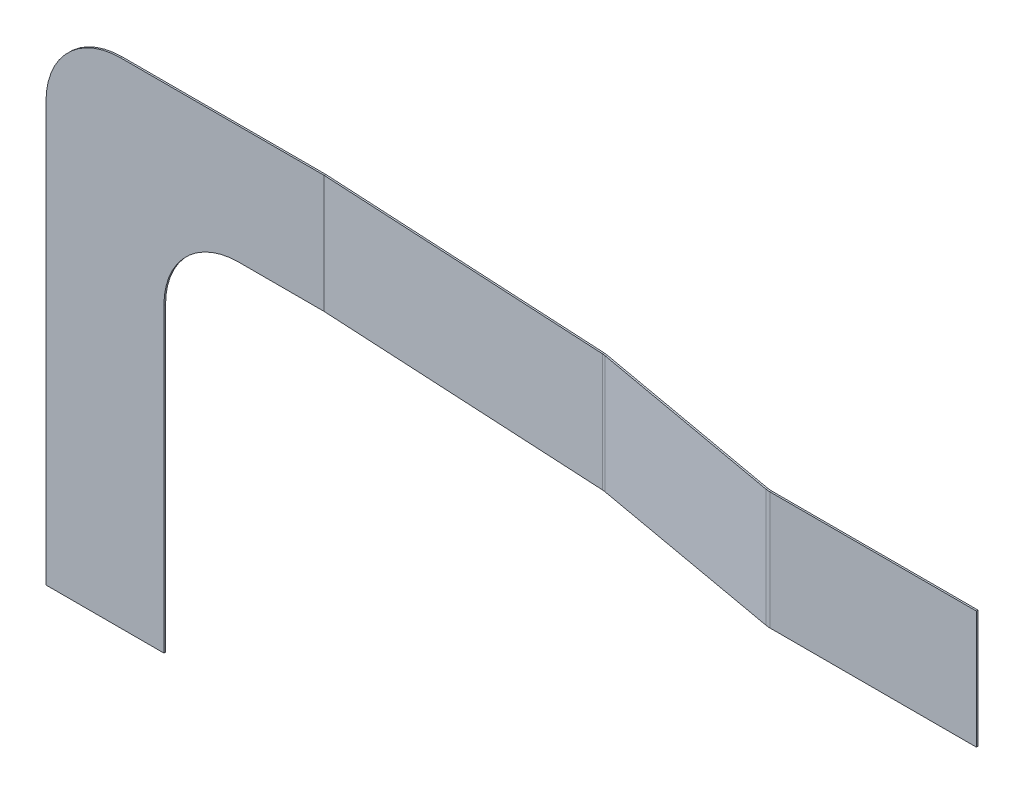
ISO-10303-21;
HEADER;
FILE_DESCRIPTION(('STEP AP214'),'2;1');
FILE_NAME('part.step','',(''),(''),'','','');
FILE_SCHEMA(('AUTOMOTIVE_DESIGN { 1 0 10303 214 1 1 1 1 }'));
ENDSEC;
DATA;
#1=APPLICATION_CONTEXT('core data for automotive mechanical design processes');
#2=APPLICATION_PROTOCOL_DEFINITION('international standard','automotive_design',2000,#1);
#3=PRODUCT_CONTEXT('',#1,'mechanical');
#4=PRODUCT('Part','Part','',(#3));
#5=PRODUCT_RELATED_PRODUCT_CATEGORY('part','',(#4));
#6=PRODUCT_DEFINITION_FORMATION('','',#4);
#7=PRODUCT_DEFINITION_CONTEXT('part definition',#1,'design');
#8=PRODUCT_DEFINITION('design','',#6,#7);
#9=PRODUCT_DEFINITION_SHAPE('','',#8);
#10=(LENGTH_UNIT() NAMED_UNIT(*) SI_UNIT(.MILLI.,.METRE.));
#11=(NAMED_UNIT(*) PLANE_ANGLE_UNIT() SI_UNIT($,.RADIAN.));
#12=(NAMED_UNIT(*) SI_UNIT($,.STERADIAN.) SOLID_ANGLE_UNIT());
#13=UNCERTAINTY_MEASURE_WITH_UNIT(LENGTH_MEASURE(1.E-05),#10,'distance_accuracy_value','');
#14=(GEOMETRIC_REPRESENTATION_CONTEXT(3) GLOBAL_UNCERTAINTY_ASSIGNED_CONTEXT((#13)) GLOBAL_UNIT_ASSIGNED_CONTEXT((#10,
#11,#12)) REPRESENTATION_CONTEXT('',''));
#15=CARTESIAN_POINT('',(0.,0.,0.));
#16=DIRECTION('',(0.,0.,1.));
#17=DIRECTION('',(1.,0.,0.));
#18=AXIS2_PLACEMENT_3D('',#15,#16,#17);
#19=CARTESIAN_POINT('',(26.5299999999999,-35.47,-5.2948));
#20=DIRECTION('',(0.,0.,-1.));
#21=DIRECTION('',(-1.,0.,0.));
#22=AXIS2_PLACEMENT_3D('',#19,#20,#21);
#23=CYLINDRICAL_SURFACE('',#22,6.35);
#24=DIRECTION('',(0.,0.,-1.));
#25=VECTOR('',#24,1.);
#26=CARTESIAN_POINT('',(26.5299999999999,-29.12,-5.2948));
#27=LINE('',#26,#25);
#28=CARTESIAN_POINT('',(26.5299999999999,-29.12,-5.1548));
#29=VERTEX_POINT('',#28);
#30=CARTESIAN_POINT('',(26.5299999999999,-29.12,-5.2948));
#31=VERTEX_POINT('',#30);
#32=EDGE_CURVE('E11',#29,#31,#27,.T.);
#33=ORIENTED_EDGE('',*,*,#32,.F.);
#34=CARTESIAN_POINT('',(26.5299999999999,-35.47,-5.1548));
#35=DIRECTION('',(0.,0.,-1.));
#36=DIRECTION('',(-1.,0.,0.));
#37=AXIS2_PLACEMENT_3D('',#34,#35,#36);
#38=CIRCLE('',#37,6.35);
#39=CARTESIAN_POINT('',(20.1799999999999,-35.47,-5.1548));
#40=VERTEX_POINT('',#39);
#41=EDGE_CURVE('E160',#29,#40,#38,.F.);
#42=ORIENTED_EDGE('',*,*,#41,.T.);
#43=DIRECTION('',(0.,0.,-1.));
#44=VECTOR('',#43,1.);
#45=CARTESIAN_POINT('',(20.1799999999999,-35.47,-5.2948));
#46=LINE('',#45,#44);
#47=CARTESIAN_POINT('',(20.1799999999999,-35.47,-5.2948));
#48=VERTEX_POINT('',#47);
#49=EDGE_CURVE('E49',#40,#48,#46,.T.);
#50=ORIENTED_EDGE('',*,*,#49,.T.);
#51=CARTESIAN_POINT('',(26.5299999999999,-35.47,-5.2948));
#52=DIRECTION('',(0.,0.,-1.));
#53=DIRECTION('',(-1.,0.,0.));
#54=AXIS2_PLACEMENT_3D('',#51,#52,#53);
#55=CIRCLE('',#54,6.35);
#56=EDGE_CURVE('E269',#31,#48,#55,.F.);
#57=ORIENTED_EDGE('',*,*,#56,.F.);
#58=EDGE_LOOP('',(#33,#42,#50,#57));
#59=FACE_BOUND('',#58,.T.);
#60=ADVANCED_FACE('F39',(#59),#23,.F.);
#61=CARTESIAN_POINT('',(20.1799999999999,-29.12,-5.2948));
#62=DIRECTION('',(-1.,0.,0.));
#63=DIRECTION('',(0.,1.,0.));
#64=AXIS2_PLACEMENT_3D('',#61,#62,#63);
#65=PLANE('',#64);
#66=ORIENTED_EDGE('',*,*,#49,.F.);
#67=DIRECTION('',(0.,1.,0.));
#68=VECTOR('',#67,1.);
#69=CARTESIAN_POINT('',(20.1799999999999,0.,-5.1548));
#70=LINE('',#69,#68);
#71=CARTESIAN_POINT('',(20.1799999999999,-61.0106,-5.1548));
#72=VERTEX_POINT('',#71);
#73=EDGE_CURVE('E170',#72,#40,#70,.T.);
#74=ORIENTED_EDGE('',*,*,#73,.F.);
#75=DIRECTION('',(0.,0.,-1.));
#76=VECTOR('',#75,1.);
#77=CARTESIAN_POINT('',(20.1799999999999,-61.0106,-5.2948));
#78=LINE('',#77,#76);
#79=CARTESIAN_POINT('',(20.1799999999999,-61.0106,-5.2948));
#80=VERTEX_POINT('',#79);
#81=EDGE_CURVE('E264',#72,#80,#78,.T.);
#82=ORIENTED_EDGE('',*,*,#81,.T.);
#83=DIRECTION('',(0.,1.,0.));
#84=VECTOR('',#83,1.);
#85=CARTESIAN_POINT('',(20.1799999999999,-29.12,-5.2948));
#86=LINE('',#85,#84);
#87=EDGE_CURVE('E277',#80,#48,#86,.T.);
#88=ORIENTED_EDGE('',*,*,#87,.T.);
#89=EDGE_LOOP('',(#66,#74,#82,#88));
#90=FACE_BOUND('',#89,.T.);
#91=ADVANCED_FACE('F279',(#90),#65,.F.);
#92=CARTESIAN_POINT('',(10.1799999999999,-61.0106,-5.2948));
#93=DIRECTION('',(0.,1.,0.));
#94=DIRECTION('',(1.,0.,0.));
#95=AXIS2_PLACEMENT_3D('',#92,#93,#94);
#96=PLANE('',#95);
#97=ORIENTED_EDGE('',*,*,#81,.F.);
#98=DIRECTION('',(-1.,0.,0.));
#99=VECTOR('',#98,1.);
#100=CARTESIAN_POINT('',(0.,-61.0106,-5.1548));
#101=LINE('',#100,#99);
#102=CARTESIAN_POINT('',(10.1799999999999,-61.0106,-5.1548));
#103=VERTEX_POINT('',#102);
#104=EDGE_CURVE('E165',#103,#72,#101,.F.);
#105=ORIENTED_EDGE('',*,*,#104,.F.);
#106=DIRECTION('',(0.,0.,-1.));
#107=VECTOR('',#106,1.);
#108=CARTESIAN_POINT('',(10.1799999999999,-61.0106,-5.2948));
#109=LINE('',#108,#107);
#110=CARTESIAN_POINT('',(10.1799999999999,-61.0106,-5.2948));
#111=VERTEX_POINT('',#110);
#112=EDGE_CURVE('E57',#103,#111,#109,.T.);
#113=ORIENTED_EDGE('',*,*,#112,.T.);
#114=DIRECTION('',(1.,0.,0.));
#115=VECTOR('',#114,1.);
#116=CARTESIAN_POINT('',(10.1799999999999,-61.0106,-5.2948));
#117=LINE('',#116,#115);
#118=EDGE_CURVE('E280',#111,#80,#117,.T.);
#119=ORIENTED_EDGE('',*,*,#118,.T.);
#120=EDGE_LOOP('',(#97,#105,#113,#119));
#121=FACE_BOUND('',#120,.T.);
#122=ADVANCED_FACE('F465',(#121),#96,.F.);
#123=CARTESIAN_POINT('',(10.1799999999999,-19.12,-5.2948));
#124=DIRECTION('',(1.,0.,0.));
#125=DIRECTION('',(0.,-1.,0.));
#126=AXIS2_PLACEMENT_3D('',#123,#124,#125);
#127=PLANE('',#126);
#128=ORIENTED_EDGE('',*,*,#112,.F.);
#129=DIRECTION('',(0.,1.,0.));
#130=VECTOR('',#129,1.);
#131=CARTESIAN_POINT('',(10.1799999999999,0.,-5.1548));
#132=LINE('',#131,#130);
#133=CARTESIAN_POINT('',(10.1799999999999,-25.47,-5.1548));
#134=VERTEX_POINT('',#133);
#135=EDGE_CURVE('E210',#134,#103,#132,.F.);
#136=ORIENTED_EDGE('',*,*,#135,.F.);
#137=DIRECTION('',(0.,0.,-1.));
#138=VECTOR('',#137,1.);
#139=CARTESIAN_POINT('',(10.1799999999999,-25.47,-5.2948));
#140=LINE('',#139,#138);
#141=CARTESIAN_POINT('',(10.1799999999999,-25.47,-5.2948));
#142=VERTEX_POINT('',#141);
#143=EDGE_CURVE('E260',#134,#142,#140,.T.);
#144=ORIENTED_EDGE('',*,*,#143,.T.);
#145=DIRECTION('',(0.,-1.,0.));
#146=VECTOR('',#145,1.);
#147=CARTESIAN_POINT('',(10.1799999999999,-19.12,-5.2948));
#148=LINE('',#147,#146);
#149=EDGE_CURVE('E375',#142,#111,#148,.T.);
#150=ORIENTED_EDGE('',*,*,#149,.T.);
#151=EDGE_LOOP('',(#128,#136,#144,#150));
#152=FACE_BOUND('',#151,.T.);
#153=ADVANCED_FACE('F470',(#152),#127,.F.);
#154=CARTESIAN_POINT('',(16.5299999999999,-25.47,-5.2948));
#155=DIRECTION('',(0.,0.,-1.));
#156=DIRECTION('',(-1.,0.,0.));
#157=AXIS2_PLACEMENT_3D('',#154,#155,#156);
#158=CYLINDRICAL_SURFACE('',#157,6.35);
#159=ORIENTED_EDGE('',*,*,#143,.F.);
#160=CARTESIAN_POINT('',(16.5299999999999,-25.47,-5.1548));
#161=DIRECTION('',(0.,0.,-1.));
#162=DIRECTION('',(-1.,0.,0.));
#163=AXIS2_PLACEMENT_3D('',#160,#161,#162);
#164=CIRCLE('',#163,6.35);
#165=CARTESIAN_POINT('',(16.5299999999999,-19.12,-5.1548));
#166=VERTEX_POINT('',#165);
#167=EDGE_CURVE('E214',#134,#166,#164,.T.);
#168=ORIENTED_EDGE('',*,*,#167,.T.);
#169=DIRECTION('',(0.,0.,-1.));
#170=VECTOR('',#169,1.);
#171=CARTESIAN_POINT('',(16.5299999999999,-19.12,-5.2948));
#172=LINE('',#171,#170);
#173=CARTESIAN_POINT('',(16.5299999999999,-19.12,-5.2948));
#174=VERTEX_POINT('',#173);
#175=EDGE_CURVE('E257',#166,#174,#172,.T.);
#176=ORIENTED_EDGE('',*,*,#175,.T.);
#177=CARTESIAN_POINT('',(16.5299999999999,-25.47,-5.2948));
#178=DIRECTION('',(0.,0.,-1.));
#179=DIRECTION('',(-1.,0.,0.));
#180=AXIS2_PLACEMENT_3D('',#177,#178,#179);
#181=CIRCLE('',#180,6.35);
#182=EDGE_CURVE('E378',#142,#174,#181,.T.);
#183=ORIENTED_EDGE('',*,*,#182,.F.);
#184=EDGE_LOOP('',(#159,#168,#176,#183));
#185=FACE_BOUND('',#184,.T.);
#186=ADVANCED_FACE('F473',(#185),#158,.T.);
#187=CARTESIAN_POINT('',(10.1799999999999,-19.12,-5.2948));
#188=DIRECTION('',(0.,-1.,0.));
#189=DIRECTION('',(-1.,0.,0.));
#190=AXIS2_PLACEMENT_3D('',#187,#188,#189);
#191=PLANE('',#190);
#192=ORIENTED_EDGE('',*,*,#175,.F.);
#193=DIRECTION('',(-1.,0.,0.));
#194=VECTOR('',#193,1.);
#195=CARTESIAN_POINT('',(0.,-19.12,-5.1548));
#196=LINE('',#195,#194);
#197=CARTESIAN_POINT('',(33.7,-19.12,-5.1548));
#198=VERTEX_POINT('',#197);
#199=EDGE_CURVE('E155',#198,#166,#196,.T.);
#200=ORIENTED_EDGE('',*,*,#199,.F.);
#201=DIRECTION('',(0.,0.,-1.));
#202=VECTOR('',#201,1.);
#203=CARTESIAN_POINT('',(33.7,-19.12,-5.2948));
#204=LINE('',#203,#202);
#205=CARTESIAN_POINT('',(33.7,-19.12,-5.2948));
#206=VERTEX_POINT('',#205);
#207=EDGE_CURVE('E254',#198,#206,#204,.T.);
#208=ORIENTED_EDGE('',*,*,#207,.T.);
#209=DIRECTION('',(-1.,0.,0.));
#210=VECTOR('',#209,1.);
#211=CARTESIAN_POINT('',(10.1799999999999,-19.12,-5.2948));
#212=LINE('',#211,#210);
#213=EDGE_CURVE('E381',#206,#174,#212,.T.);
#214=ORIENTED_EDGE('',*,*,#213,.T.);
#215=EDGE_LOOP('',(#192,#200,#208,#214));
#216=FACE_BOUND('',#215,.T.);
#217=ADVANCED_FACE('F477',(#216),#191,.F.);
#218=CARTESIAN_POINT('',(33.7,-19.12,-3.1548));
#219=DIRECTION('',(0.,-1.,0.));
#220=DIRECTION('',(0.,0.,-1.));
#221=AXIS2_PLACEMENT_3D('',#218,#219,#220);
#222=PLANE('',#221);
#223=ORIENTED_EDGE('',*,*,#207,.F.);
#224=CARTESIAN_POINT('',(33.7,-19.12,-3.1548));
#225=DIRECTION('',(0.,1.,0.));
#226=DIRECTION('',(0.,0.,1.));
#227=AXIS2_PLACEMENT_3D('',#224,#225,#226);
#228=CIRCLE('',#227,2.);
#229=CARTESIAN_POINT('',(33.8046719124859,-19.12,-5.15205906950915));
#230=VERTEX_POINT('',#229);
#231=EDGE_CURVE('E151',#230,#198,#228,.T.);
#232=ORIENTED_EDGE('',*,*,#231,.F.);
#233=DIRECTION('',(0.0523359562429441,0.,-0.998629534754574));
#234=VECTOR('',#233,1.);
#235=CARTESIAN_POINT('',(33.8119989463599,-19.12,-5.29186720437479));
#236=LINE('',#235,#234);
#237=CARTESIAN_POINT('',(33.8119989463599,-19.12,-5.29186720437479));
#238=VERTEX_POINT('',#237);
#239=EDGE_CURVE('E251',#230,#238,#236,.T.);
#240=ORIENTED_EDGE('',*,*,#239,.T.);
#241=CARTESIAN_POINT('',(33.7,-19.12,-3.1548));
#242=DIRECTION('',(0.,1.,0.));
#243=DIRECTION('',(0.,0.,1.));
#244=AXIS2_PLACEMENT_3D('',#241,#242,#243);
#245=CIRCLE('',#244,2.14);
#246=EDGE_CURVE('E140',#238,#206,#245,.T.);
#247=ORIENTED_EDGE('',*,*,#246,.T.);
#248=EDGE_LOOP('',(#223,#232,#240,#247));
#249=FACE_BOUND('',#248,.T.);
#250=ADVANCED_FACE('F481',(#249),#222,.F.);
#251=CARTESIAN_POINT('',(33.8119989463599,-19.12,-5.29186720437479));
#252=DIRECTION('',(0.,-1.,0.));
#253=DIRECTION('',(-0.998629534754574,0.,-0.0523359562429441));
#254=AXIS2_PLACEMENT_3D('',#251,#252,#253);
#255=PLANE('',#254);
#256=ORIENTED_EDGE('',*,*,#239,.F.);
#257=DIRECTION('',(-0.998629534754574,0.,-0.0523359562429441));
#258=VECTOR('',#257,1.);
#259=CARTESIAN_POINT('',(33.8046719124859,-19.12,-5.15205906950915));
#260=LINE('',#259,#258);
#261=CARTESIAN_POINT('',(58.6726729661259,-19.12,-3.84878235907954));
#262=VERTEX_POINT('',#261);
#263=EDGE_CURVE('E184',#262,#230,#260,.T.);
#264=ORIENTED_EDGE('',*,*,#263,.F.);
#265=DIRECTION('',(0.0523359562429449,0.,-0.998629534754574));
#266=VECTOR('',#265,1.);
#267=CARTESIAN_POINT('',(58.6799999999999,-19.12,-3.98859049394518));
#268=LINE('',#267,#266);
#269=CARTESIAN_POINT('',(58.6799999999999,-19.12,-3.98859049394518));
#270=VERTEX_POINT('',#269);
#271=EDGE_CURVE('E248',#262,#270,#268,.T.);
#272=ORIENTED_EDGE('',*,*,#271,.T.);
#273=DIRECTION('',(-0.998629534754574,0.,-0.0523359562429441));
#274=VECTOR('',#273,1.);
#275=CARTESIAN_POINT('',(33.8119989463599,-19.12,-5.29186720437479));
#276=LINE('',#275,#274);
#277=EDGE_CURVE('E367',#270,#238,#276,.T.);
#278=ORIENTED_EDGE('',*,*,#277,.T.);
#279=EDGE_LOOP('',(#256,#264,#272,#278));
#280=FACE_BOUND('',#279,.T.);
#281=ADVANCED_FACE('F485',(#280),#255,.F.);
#282=CARTESIAN_POINT('',(58.56800105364,-19.12,-1.85152328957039));
#283=DIRECTION('',(0.,-1.,0.));
#284=DIRECTION('',(0.,0.,-1.));
#285=AXIS2_PLACEMENT_3D('',#282,#283,#284);
#286=PLANE('',#285);
#287=ORIENTED_EDGE('',*,*,#271,.F.);
#288=CARTESIAN_POINT('',(58.56800105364,-19.12,-1.85152328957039));
#289=DIRECTION('',(0.,1.,0.));
#290=DIRECTION('',(0.,0.,1.));
#291=AXIS2_PLACEMENT_3D('',#288,#289,#290);
#292=CIRCLE('',#291,2.);
#293=CARTESIAN_POINT('',(58.920289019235,-19.12,-3.8202521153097));
#294=VERTEX_POINT('',#293);
#295=EDGE_CURVE('E183',#294,#262,#292,.T.);
#296=ORIENTED_EDGE('',*,*,#295,.F.);
#297=DIRECTION('',(0.176143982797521,0.,-0.984364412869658));
#298=VECTOR('',#297,1.);
#299=CARTESIAN_POINT('',(58.9449491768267,-19.12,-3.95806313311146));
#300=LINE('',#299,#298);
#301=CARTESIAN_POINT('',(58.9449491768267,-19.12,-3.95806313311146));
#302=VERTEX_POINT('',#301);
#303=EDGE_CURVE('E245',#294,#302,#300,.T.);
#304=ORIENTED_EDGE('',*,*,#303,.T.);
#305=CARTESIAN_POINT('',(58.56800105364,-19.12,-1.85152328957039));
#306=DIRECTION('',(0.,1.,0.));
#307=DIRECTION('',(0.,0.,-1.));
#308=AXIS2_PLACEMENT_3D('',#305,#306,#307);
#309=CIRCLE('',#308,2.14);
#310=EDGE_CURVE('E373',#302,#270,#309,.T.);
#311=ORIENTED_EDGE('',*,*,#310,.T.);
#312=EDGE_LOOP('',(#287,#296,#304,#311));
#313=FACE_BOUND('',#312,.T.);
#314=ADVANCED_FACE('F445',(#313),#286,.F.);
#315=CARTESIAN_POINT('',(58.9449491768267,-19.12,-3.95806313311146));
#316=DIRECTION('',(0.,-1.,0.));
#317=DIRECTION('',(-0.984364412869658,0.,-0.176143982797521));
#318=AXIS2_PLACEMENT_3D('',#315,#316,#317);
#319=PLANE('',#318);
#320=ORIENTED_EDGE('',*,*,#303,.F.);
#321=DIRECTION('',(-0.984364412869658,0.,-0.176143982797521));
#322=VECTOR('',#321,1.);
#323=CARTESIAN_POINT('',(58.920289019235,-19.12,-3.8202521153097));
#324=LINE('',#323,#322);
#325=CARTESIAN_POINT('',(75.5580518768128,-19.12,-0.843060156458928));
#326=VERTEX_POINT('',#325);
#327=EDGE_CURVE('E194',#326,#294,#324,.T.);
#328=ORIENTED_EDGE('',*,*,#327,.F.);
#329=DIRECTION('',(0.17614398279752,0.,-0.984364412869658));
#330=VECTOR('',#329,1.);
#331=CARTESIAN_POINT('',(75.5827120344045,-19.12,-0.980871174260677));
#332=LINE('',#331,#330);
#333=CARTESIAN_POINT('',(75.5827120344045,-19.12,-0.980871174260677));
#334=VERTEX_POINT('',#333);
#335=EDGE_CURVE('E242',#326,#334,#332,.T.);
#336=ORIENTED_EDGE('',*,*,#335,.T.);
#337=DIRECTION('',(-0.984364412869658,0.,-0.176143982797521));
#338=VECTOR('',#337,1.);
#339=CARTESIAN_POINT('',(58.9449491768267,-19.12,-3.95806313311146));
#340=LINE('',#339,#338);
#341=EDGE_CURVE('E314',#334,#302,#340,.T.);
#342=ORIENTED_EDGE('',*,*,#341,.T.);
#343=EDGE_LOOP('',(#320,#328,#336,#342));
#344=FACE_BOUND('',#343,.T.);
#345=ADVANCED_FACE('F309',(#344),#319,.F.);
#346=CARTESIAN_POINT('',(75.9349999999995,-19.12,-2.9496));
#347=DIRECTION('',(0.,1.,0.));
#348=DIRECTION('',(0.,0.,1.));
#349=AXIS2_PLACEMENT_3D('',#346,#347,#348);
#350=PLANE('',#349);
#351=ORIENTED_EDGE('',*,*,#335,.F.);
#352=CARTESIAN_POINT('',(75.9349999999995,-19.12,-2.9496));
#353=DIRECTION('',(0.,1.,0.));
#354=DIRECTION('',(0.,0.,1.));
#355=AXIS2_PLACEMENT_3D('',#352,#353,#354);
#356=CIRCLE('',#355,2.14);
#357=CARTESIAN_POINT('',(75.9349999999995,-19.12,-0.809599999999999));
#358=VERTEX_POINT('',#357);
#359=EDGE_CURVE('E193',#358,#326,#356,.F.);
#360=ORIENTED_EDGE('',*,*,#359,.F.);
#361=DIRECTION('',(0.,0.,-1.));
#362=VECTOR('',#361,1.);
#363=CARTESIAN_POINT('',(75.9349999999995,-19.12,-0.949599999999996));
#364=LINE('',#363,#362);
#365=CARTESIAN_POINT('',(75.9349999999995,-19.12,-0.949599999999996));
#366=VERTEX_POINT('',#365);
#367=EDGE_CURVE('E239',#358,#366,#364,.T.);
#368=ORIENTED_EDGE('',*,*,#367,.T.);
#369=CARTESIAN_POINT('',(75.9349999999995,-19.12,-2.9496));
#370=DIRECTION('',(0.,-1.,0.));
#371=DIRECTION('',(0.,0.,-1.));
#372=AXIS2_PLACEMENT_3D('',#369,#370,#371);
#373=CIRCLE('',#372,2.);
#374=EDGE_CURVE('E350',#366,#334,#373,.T.);
#375=ORIENTED_EDGE('',*,*,#374,.T.);
#376=EDGE_LOOP('',(#351,#360,#368,#375));
#377=FACE_BOUND('',#376,.T.);
#378=ADVANCED_FACE('F493',(#377),#350,.T.);
#379=CARTESIAN_POINT('',(75.9349999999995,-19.12,-0.949599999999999));
#380=DIRECTION('',(0.,-1.,0.));
#381=DIRECTION('',(-1.,0.,0.));
#382=AXIS2_PLACEMENT_3D('',#379,#380,#381);
#383=PLANE('',#382);
#384=ORIENTED_EDGE('',*,*,#367,.F.);
#385=DIRECTION('',(-1.,0.,0.));
#386=VECTOR('',#385,1.);
#387=CARTESIAN_POINT('',(75.9349999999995,-19.12,-0.809599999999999));
#388=LINE('',#387,#386);
#389=CARTESIAN_POINT('',(93.435,-19.12,-0.809599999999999));
#390=VERTEX_POINT('',#389);
#391=EDGE_CURVE('E201',#390,#358,#388,.T.);
#392=ORIENTED_EDGE('',*,*,#391,.F.);
#393=DIRECTION('',(0.,0.,-1.));
#394=VECTOR('',#393,1.);
#395=CARTESIAN_POINT('',(93.435,-19.12,-0.949599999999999));
#396=LINE('',#395,#394);
#397=CARTESIAN_POINT('',(93.435,-19.12,-0.949599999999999));
#398=VERTEX_POINT('',#397);
#399=EDGE_CURVE('E236',#390,#398,#396,.T.);
#400=ORIENTED_EDGE('',*,*,#399,.T.);
#401=DIRECTION('',(-1.,0.,0.));
#402=VECTOR('',#401,1.);
#403=CARTESIAN_POINT('',(75.9349999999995,-19.12,-0.949599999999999));
#404=LINE('',#403,#402);
#405=EDGE_CURVE('E429',#398,#366,#404,.T.);
#406=ORIENTED_EDGE('',*,*,#405,.T.);
#407=EDGE_LOOP('',(#384,#392,#400,#406));
#408=FACE_BOUND('',#407,.T.);
#409=ADVANCED_FACE('F496',(#408),#383,.F.);
#410=CARTESIAN_POINT('',(93.435,-90.0207415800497,-0.949599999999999));
#411=DIRECTION('',(-1.,0.,0.));
#412=DIRECTION('',(0.,1.,0.));
#413=AXIS2_PLACEMENT_3D('',#410,#411,#412);
#414=PLANE('',#413);
#415=ORIENTED_EDGE('',*,*,#399,.F.);
#416=DIRECTION('',(0.,1.,0.));
#417=VECTOR('',#416,1.);
#418=CARTESIAN_POINT('',(93.435,-90.0207415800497,-0.809599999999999));
#419=LINE('',#418,#417);
#420=CARTESIAN_POINT('',(93.435,-29.12,-0.809599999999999));
#421=VERTEX_POINT('',#420);
#422=EDGE_CURVE('E198',#421,#390,#419,.T.);
#423=ORIENTED_EDGE('',*,*,#422,.F.);
#424=DIRECTION('',(0.,0.,-1.));
#425=VECTOR('',#424,1.);
#426=CARTESIAN_POINT('',(93.435,-29.12,-0.949599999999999));
#427=LINE('',#426,#425);
#428=CARTESIAN_POINT('',(93.435,-29.12,-0.949599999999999));
#429=VERTEX_POINT('',#428);
#430=EDGE_CURVE('E233',#421,#429,#427,.T.);
#431=ORIENTED_EDGE('',*,*,#430,.T.);
#432=DIRECTION('',(0.,1.,0.));
#433=VECTOR('',#432,1.);
#434=CARTESIAN_POINT('',(93.435,-90.0207415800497,-0.949599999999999));
#435=LINE('',#434,#433);
#436=EDGE_CURVE('E167',#429,#398,#435,.T.);
#437=ORIENTED_EDGE('',*,*,#436,.T.);
#438=EDGE_LOOP('',(#415,#423,#431,#437));
#439=FACE_BOUND('',#438,.T.);
#440=ADVANCED_FACE('F419',(#439),#414,.F.);
#441=CARTESIAN_POINT('',(75.9349999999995,-29.12,-0.949599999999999));
#442=DIRECTION('',(0.,-1.,0.));
#443=DIRECTION('',(-1.,0.,0.));
#444=AXIS2_PLACEMENT_3D('',#441,#442,#443);
#445=PLANE('',#444);
#446=ORIENTED_EDGE('',*,*,#430,.F.);
#447=DIRECTION('',(-1.,0.,0.));
#448=VECTOR('',#447,1.);
#449=CARTESIAN_POINT('',(75.9349999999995,-29.12,-0.809599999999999));
#450=LINE('',#449,#448);
#451=CARTESIAN_POINT('',(75.9349999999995,-29.12,-0.809599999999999));
#452=VERTEX_POINT('',#451);
#453=EDGE_CURVE('E195',#421,#452,#450,.T.);
#454=ORIENTED_EDGE('',*,*,#453,.T.);
#455=DIRECTION('',(0.,0.,-1.));
#456=VECTOR('',#455,1.);
#457=CARTESIAN_POINT('',(75.9349999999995,-29.12,-0.949599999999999));
#458=LINE('',#457,#456);
#459=CARTESIAN_POINT('',(75.9349999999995,-29.12,-0.949599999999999));
#460=VERTEX_POINT('',#459);
#461=EDGE_CURVE('E230',#452,#460,#458,.T.);
#462=ORIENTED_EDGE('',*,*,#461,.T.);
#463=DIRECTION('',(-1.,0.,0.));
#464=VECTOR('',#463,1.);
#465=CARTESIAN_POINT('',(75.9349999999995,-29.12,-0.949599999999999));
#466=LINE('',#465,#464);
#467=EDGE_CURVE('E427',#429,#460,#466,.T.);
#468=ORIENTED_EDGE('',*,*,#467,.F.);
#469=EDGE_LOOP('',(#446,#454,#462,#468));
#470=FACE_BOUND('',#469,.T.);
#471=ADVANCED_FACE('F431',(#470),#445,.T.);
#472=CARTESIAN_POINT('',(75.9349999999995,-29.12,-2.9496));
#473=DIRECTION('',(0.,1.,0.));
#474=DIRECTION('',(0.,0.,1.));
#475=AXIS2_PLACEMENT_3D('',#472,#473,#474);
#476=PLANE('',#475);
#477=ORIENTED_EDGE('',*,*,#461,.F.);
#478=CARTESIAN_POINT('',(75.9349999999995,-29.12,-2.9496));
#479=DIRECTION('',(0.,1.,0.));
#480=DIRECTION('',(0.,0.,1.));
#481=AXIS2_PLACEMENT_3D('',#478,#479,#480);
#482=CIRCLE('',#481,2.14);
#483=CARTESIAN_POINT('',(75.5580518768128,-29.12,-0.843060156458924));
#484=VERTEX_POINT('',#483);
#485=EDGE_CURVE('E190',#452,#484,#482,.F.);
#486=ORIENTED_EDGE('',*,*,#485,.T.);
#487=DIRECTION('',(0.176143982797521,0.,-0.984364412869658));
#488=VECTOR('',#487,1.);
#489=CARTESIAN_POINT('',(75.5827120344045,-29.12,-0.98087117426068));
#490=LINE('',#489,#488);
#491=CARTESIAN_POINT('',(75.5827120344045,-29.12,-0.98087117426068));
#492=VERTEX_POINT('',#491);
#493=EDGE_CURVE('E227',#484,#492,#490,.T.);
#494=ORIENTED_EDGE('',*,*,#493,.T.);
#495=CARTESIAN_POINT('',(75.9349999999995,-29.12,-2.9496));
#496=DIRECTION('',(0.,-1.,0.));
#497=DIRECTION('',(0.,0.,-1.));
#498=AXIS2_PLACEMENT_3D('',#495,#496,#497);
#499=CIRCLE('',#498,2.);
#500=EDGE_CURVE('E339',#460,#492,#499,.T.);
#501=ORIENTED_EDGE('',*,*,#500,.F.);
#502=EDGE_LOOP('',(#477,#486,#494,#501));
#503=FACE_BOUND('',#502,.T.);
#504=ADVANCED_FACE('F337',(#503),#476,.F.);
#505=CARTESIAN_POINT('',(58.9449491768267,-29.12,-3.95806313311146));
#506=DIRECTION('',(0.,-1.,0.));
#507=DIRECTION('',(-0.984364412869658,0.,-0.176143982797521));
#508=AXIS2_PLACEMENT_3D('',#505,#506,#507);
#509=PLANE('',#508);
#510=ORIENTED_EDGE('',*,*,#493,.F.);
#511=DIRECTION('',(-0.984364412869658,0.,-0.176143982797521));
#512=VECTOR('',#511,1.);
#513=CARTESIAN_POINT('',(58.920289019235,-29.12,-3.8202521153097));
#514=LINE('',#513,#512);
#515=CARTESIAN_POINT('',(58.920289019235,-29.12,-3.8202521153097));
#516=VERTEX_POINT('',#515);
#517=EDGE_CURVE('E185',#484,#516,#514,.T.);
#518=ORIENTED_EDGE('',*,*,#517,.T.);
#519=DIRECTION('',(0.17614398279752,0.,-0.984364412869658));
#520=VECTOR('',#519,1.);
#521=CARTESIAN_POINT('',(58.9449491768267,-29.12,-3.95806313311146));
#522=LINE('',#521,#520);
#523=CARTESIAN_POINT('',(58.9449491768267,-29.12,-3.95806313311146));
#524=VERTEX_POINT('',#523);
#525=EDGE_CURVE('E224',#516,#524,#522,.T.);
#526=ORIENTED_EDGE('',*,*,#525,.T.);
#527=DIRECTION('',(-0.984364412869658,0.,-0.176143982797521));
#528=VECTOR('',#527,1.);
#529=CARTESIAN_POINT('',(58.9449491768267,-29.12,-3.95806313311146));
#530=LINE('',#529,#528);
#531=EDGE_CURVE('E332',#492,#524,#530,.T.);
#532=ORIENTED_EDGE('',*,*,#531,.F.);
#533=EDGE_LOOP('',(#510,#518,#526,#532));
#534=FACE_BOUND('',#533,.T.);
#535=ADVANCED_FACE('F327',(#534),#509,.T.);
#536=CARTESIAN_POINT('',(58.56800105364,-29.12,-1.85152328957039));
#537=DIRECTION('',(0.,1.,0.));
#538=DIRECTION('',(0.,0.,1.));
#539=AXIS2_PLACEMENT_3D('',#536,#537,#538);
#540=PLANE('',#539);
#541=ORIENTED_EDGE('',*,*,#525,.F.);
#542=CARTESIAN_POINT('',(58.56800105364,-29.12,-1.85152328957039));
#543=DIRECTION('',(0.,1.,0.));
#544=DIRECTION('',(0.,0.,1.));
#545=AXIS2_PLACEMENT_3D('',#542,#543,#544);
#546=CIRCLE('',#545,2.);
#547=CARTESIAN_POINT('',(58.6726729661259,-29.12,-3.84878235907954));
#548=VERTEX_POINT('',#547);
#549=EDGE_CURVE('E180',#516,#548,#546,.T.);
#550=ORIENTED_EDGE('',*,*,#549,.T.);
#551=DIRECTION('',(0.0523359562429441,0.,-0.998629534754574));
#552=VECTOR('',#551,1.);
#553=CARTESIAN_POINT('',(58.6799999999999,-29.12,-3.98859049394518));
#554=LINE('',#553,#552);
#555=CARTESIAN_POINT('',(58.6799999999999,-29.12,-3.98859049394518));
#556=VERTEX_POINT('',#555);
#557=EDGE_CURVE('E221',#548,#556,#554,.T.);
#558=ORIENTED_EDGE('',*,*,#557,.T.);
#559=CARTESIAN_POINT('',(58.56800105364,-29.12,-1.85152328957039));
#560=DIRECTION('',(0.,-1.,0.));
#561=DIRECTION('',(0.,0.,-1.));
#562=AXIS2_PLACEMENT_3D('',#559,#560,#561);
#563=CIRCLE('',#562,2.14);
#564=EDGE_CURVE('E370',#524,#556,#563,.F.);
#565=ORIENTED_EDGE('',*,*,#564,.F.);
#566=EDGE_LOOP('',(#541,#550,#558,#565));
#567=FACE_BOUND('',#566,.T.);
#568=ADVANCED_FACE('F452',(#567),#540,.F.);
#569=CARTESIAN_POINT('',(33.8119989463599,-29.12,-5.29186720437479));
#570=DIRECTION('',(0.,-1.,0.));
#571=DIRECTION('',(-0.998629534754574,0.,-0.0523359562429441));
#572=AXIS2_PLACEMENT_3D('',#569,#570,#571);
#573=PLANE('',#572);
#574=ORIENTED_EDGE('',*,*,#557,.F.);
#575=DIRECTION('',(-0.998629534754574,0.,-0.0523359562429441));
#576=VECTOR('',#575,1.);
#577=CARTESIAN_POINT('',(33.8046719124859,-29.12,-5.15205906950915));
#578=LINE('',#577,#576);
#579=CARTESIAN_POINT('',(33.8046719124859,-29.12,-5.15205906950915));
#580=VERTEX_POINT('',#579);
#581=EDGE_CURVE('E176',#548,#580,#578,.T.);
#582=ORIENTED_EDGE('',*,*,#581,.T.);
#583=DIRECTION('',(0.052335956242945,0.,-0.998629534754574));
#584=VECTOR('',#583,1.);
#585=CARTESIAN_POINT('',(33.8119989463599,-29.12,-5.29186720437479));
#586=LINE('',#585,#584);
#587=CARTESIAN_POINT('',(33.8119989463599,-29.12,-5.29186720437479));
#588=VERTEX_POINT('',#587);
#589=EDGE_CURVE('E139',#580,#588,#586,.T.);
#590=ORIENTED_EDGE('',*,*,#589,.T.);
#591=DIRECTION('',(-0.998629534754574,0.,-0.0523359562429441));
#592=VECTOR('',#591,1.);
#593=CARTESIAN_POINT('',(33.8119989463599,-29.12,-5.29186720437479));
#594=LINE('',#593,#592);
#595=EDGE_CURVE('E361',#556,#588,#594,.T.);
#596=ORIENTED_EDGE('',*,*,#595,.F.);
#597=EDGE_LOOP('',(#574,#582,#590,#596));
#598=FACE_BOUND('',#597,.T.);
#599=ADVANCED_FACE('F451',(#598),#573,.T.);
#600=CARTESIAN_POINT('',(33.7,-29.12,-3.1548));
#601=DIRECTION('',(0.,1.,0.));
#602=DIRECTION('',(0.,0.,1.));
#603=AXIS2_PLACEMENT_3D('',#600,#601,#602);
#604=PLANE('',#603);
#605=ORIENTED_EDGE('',*,*,#589,.F.);
#606=CARTESIAN_POINT('',(33.7,-29.12,-3.1548));
#607=DIRECTION('',(0.,1.,0.));
#608=DIRECTION('',(0.,0.,1.));
#609=AXIS2_PLACEMENT_3D('',#606,#607,#608);
#610=CIRCLE('',#609,2.);
#611=CARTESIAN_POINT('',(33.7,-29.12,-5.1548));
#612=VERTEX_POINT('',#611);
#613=EDGE_CURVE('E148',#580,#612,#610,.T.);
#614=ORIENTED_EDGE('',*,*,#613,.T.);
#615=DIRECTION('',(0.,0.,-1.));
#616=VECTOR('',#615,1.);
#617=CARTESIAN_POINT('',(33.7,-29.12,-5.2948));
#618=LINE('',#617,#616);
#619=CARTESIAN_POINT('',(33.7,-29.12,-5.2948));
#620=VERTEX_POINT('',#619);
#621=EDGE_CURVE('E43',#612,#620,#618,.T.);
#622=ORIENTED_EDGE('',*,*,#621,.T.);
#623=CARTESIAN_POINT('',(33.7,-29.12,-3.1548));
#624=DIRECTION('',(0.,-1.,0.));
#625=DIRECTION('',(0.,0.,-1.));
#626=AXIS2_PLACEMENT_3D('',#623,#624,#625);
#627=CIRCLE('',#626,2.14);
#628=EDGE_CURVE('E282',#588,#620,#627,.F.);
#629=ORIENTED_EDGE('',*,*,#628,.F.);
#630=EDGE_LOOP('',(#605,#614,#622,#629));
#631=FACE_BOUND('',#630,.T.);
#632=ADVANCED_FACE('F162',(#631),#604,.F.);
#633=CARTESIAN_POINT('',(20.1799999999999,-29.12,-5.2948));
#634=DIRECTION('',(0.,1.,0.));
#635=DIRECTION('',(1.,0.,0.));
#636=AXIS2_PLACEMENT_3D('',#633,#634,#635);
#637=PLANE('',#636);
#638=DIRECTION('',(-1.,0.,0.));
#639=VECTOR('',#638,1.);
#640=CARTESIAN_POINT('',(0.,-29.12,-5.1548));
#641=LINE('',#640,#639);
#642=EDGE_CURVE('E130',#29,#612,#641,.F.);
#643=ORIENTED_EDGE('',*,*,#642,.F.);
#644=ORIENTED_EDGE('',*,*,#32,.T.);
#645=DIRECTION('',(1.,0.,0.));
#646=VECTOR('',#645,1.);
#647=CARTESIAN_POINT('',(20.1799999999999,-29.12,-5.2948));
#648=LINE('',#647,#646);
#649=EDGE_CURVE('E133',#31,#620,#648,.T.);
#650=ORIENTED_EDGE('',*,*,#649,.T.);
#651=ORIENTED_EDGE('',*,*,#621,.F.);
#652=EDGE_LOOP('',(#643,#644,#650,#651));
#653=FACE_BOUND('',#652,.T.);
#654=ADVANCED_FACE('F41',(#653),#637,.F.);
#655=CARTESIAN_POINT('',(33.7,-90.0207415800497,-3.1548));
#656=DIRECTION('',(0.,1.,0.));
#657=DIRECTION('',(0.,0.,1.));
#658=AXIS2_PLACEMENT_3D('',#655,#656,#657);
#659=CYLINDRICAL_SURFACE('',#658,2.14);
#660=DIRECTION('',(0.,1.,0.));
#661=VECTOR('',#660,1.);
#662=CARTESIAN_POINT('',(33.8119989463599,-90.0207415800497,-5.29186720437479));
#663=LINE('',#662,#661);
#664=EDGE_CURVE('E364',#588,#238,#663,.T.);
#665=ORIENTED_EDGE('',*,*,#664,.F.);
#666=ORIENTED_EDGE('',*,*,#628,.T.);
#667=DIRECTION('',(0.,1.,0.));
#668=VECTOR('',#667,1.);
#669=CARTESIAN_POINT('',(33.7,-90.0207415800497,-5.2948));
#670=LINE('',#669,#668);
#671=EDGE_CURVE('E384',#620,#206,#670,.T.);
#672=ORIENTED_EDGE('',*,*,#671,.T.);
#673=ORIENTED_EDGE('',*,*,#246,.F.);
#674=EDGE_LOOP('',(#665,#666,#672,#673));
#675=FACE_BOUND('',#674,.T.);
#676=ADVANCED_FACE('F390',(#675),#659,.T.);
#677=CARTESIAN_POINT('',(0.,0.,-5.2948));
#678=DIRECTION('',(0.,0.,-1.));
#679=DIRECTION('',(-1.,0.,0.));
#680=AXIS2_PLACEMENT_3D('',#677,#678,#679);
#681=PLANE('',#680);
#682=ORIENTED_EDGE('',*,*,#149,.F.);
#683=ORIENTED_EDGE('',*,*,#182,.T.);
#684=ORIENTED_EDGE('',*,*,#213,.F.);
#685=ORIENTED_EDGE('',*,*,#671,.F.);
#686=ORIENTED_EDGE('',*,*,#649,.F.);
#687=ORIENTED_EDGE('',*,*,#56,.T.);
#688=ORIENTED_EDGE('',*,*,#87,.F.);
#689=ORIENTED_EDGE('',*,*,#118,.F.);
#690=EDGE_LOOP('',(#682,#683,#684,#685,#686,#687,#688,#689));
#691=FACE_BOUND('',#690,.T.);
#692=ADVANCED_FACE('F276',(#691),#681,.T.);
#693=CARTESIAN_POINT('',(58.56800105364,-90.0207415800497,-1.85152328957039));
#694=DIRECTION('',(0.,1.,0.));
#695=DIRECTION('',(0.,0.,1.));
#696=AXIS2_PLACEMENT_3D('',#693,#694,#695);
#697=CYLINDRICAL_SURFACE('',#696,2.14);
#698=DIRECTION('',(0.,1.,0.));
#699=VECTOR('',#698,1.);
#700=CARTESIAN_POINT('',(58.9449491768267,-90.0207415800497,-3.95806313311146));
#701=LINE('',#700,#699);
#702=EDGE_CURVE('E355',#524,#302,#701,.T.);
#703=ORIENTED_EDGE('',*,*,#702,.F.);
#704=ORIENTED_EDGE('',*,*,#564,.T.);
#705=DIRECTION('',(0.,1.,0.));
#706=VECTOR('',#705,1.);
#707=CARTESIAN_POINT('',(58.6799999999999,-90.0207415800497,-3.98859049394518));
#708=LINE('',#707,#706);
#709=EDGE_CURVE('E353',#556,#270,#708,.T.);
#710=ORIENTED_EDGE('',*,*,#709,.T.);
#711=ORIENTED_EDGE('',*,*,#310,.F.);
#712=EDGE_LOOP('',(#703,#704,#710,#711));
#713=FACE_BOUND('',#712,.T.);
#714=ADVANCED_FACE('F442',(#713),#697,.T.);
#715=CARTESIAN_POINT('',(33.8119989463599,-90.0207415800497,-5.29186720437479));
#716=DIRECTION('',(0.0523359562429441,0.,-0.998629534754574));
#717=DIRECTION('',(-0.998629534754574,0.,-0.0523359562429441));
#718=AXIS2_PLACEMENT_3D('',#715,#716,#717);
#719=PLANE('',#718);
#720=ORIENTED_EDGE('',*,*,#709,.F.);
#721=ORIENTED_EDGE('',*,*,#595,.T.);
#722=ORIENTED_EDGE('',*,*,#664,.T.);
#723=ORIENTED_EDGE('',*,*,#277,.F.);
#724=EDGE_LOOP('',(#720,#721,#722,#723));
#725=FACE_BOUND('',#724,.T.);
#726=ADVANCED_FACE('F725',(#725),#719,.T.);
#727=CARTESIAN_POINT('',(75.9349999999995,-90.0207415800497,-2.9496));
#728=DIRECTION('',(0.,1.,0.));
#729=DIRECTION('',(0.,0.,1.));
#730=AXIS2_PLACEMENT_3D('',#727,#728,#729);
#731=CYLINDRICAL_SURFACE('',#730,2.);
#732=DIRECTION('',(0.,1.,0.));
#733=VECTOR('',#732,1.);
#734=CARTESIAN_POINT('',(75.9349999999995,-90.0207415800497,-0.949599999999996));
#735=LINE('',#734,#733);
#736=EDGE_CURVE('E349',#460,#366,#735,.T.);
#737=ORIENTED_EDGE('',*,*,#736,.F.);
#738=ORIENTED_EDGE('',*,*,#500,.T.);
#739=DIRECTION('',(0.,1.,0.));
#740=VECTOR('',#739,1.);
#741=CARTESIAN_POINT('',(75.5827120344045,-90.0207415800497,-0.980871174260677));
#742=LINE('',#741,#740);
#743=EDGE_CURVE('E347',#492,#334,#742,.T.);
#744=ORIENTED_EDGE('',*,*,#743,.T.);
#745=ORIENTED_EDGE('',*,*,#374,.F.);
#746=EDGE_LOOP('',(#737,#738,#744,#745));
#747=FACE_BOUND('',#746,.T.);
#748=ADVANCED_FACE('F345',(#747),#731,.F.);
#749=CARTESIAN_POINT('',(58.9449491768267,-90.0207415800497,-3.95806313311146));
#750=DIRECTION('',(0.176143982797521,0.,-0.984364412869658));
#751=DIRECTION('',(-0.984364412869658,0.,-0.176143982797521));
#752=AXIS2_PLACEMENT_3D('',#749,#750,#751);
#753=PLANE('',#752);
#754=ORIENTED_EDGE('',*,*,#743,.F.);
#755=ORIENTED_EDGE('',*,*,#531,.T.);
#756=ORIENTED_EDGE('',*,*,#702,.T.);
#757=ORIENTED_EDGE('',*,*,#341,.F.);
#758=EDGE_LOOP('',(#754,#755,#756,#757));
#759=FACE_BOUND('',#758,.T.);
#760=ADVANCED_FACE('F439',(#759),#753,.T.);
#761=CARTESIAN_POINT('',(75.9349999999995,-90.0207415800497,-0.949599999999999));
#762=DIRECTION('',(0.,0.,-1.));
#763=DIRECTION('',(-1.,0.,0.));
#764=AXIS2_PLACEMENT_3D('',#761,#762,#763);
#765=PLANE('',#764);
#766=ORIENTED_EDGE('',*,*,#436,.F.);
#767=ORIENTED_EDGE('',*,*,#467,.T.);
#768=ORIENTED_EDGE('',*,*,#736,.T.);
#769=ORIENTED_EDGE('',*,*,#405,.F.);
#770=EDGE_LOOP('',(#766,#767,#768,#769));
#771=FACE_BOUND('',#770,.T.);
#772=ADVANCED_FACE('F426',(#771),#765,.T.);
#773=CARTESIAN_POINT('',(33.7,-90.0207415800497,-3.1548));
#774=DIRECTION('',(0.,1.,0.));
#775=DIRECTION('',(0.,0.,1.));
#776=AXIS2_PLACEMENT_3D('',#773,#774,#775);
#777=CYLINDRICAL_SURFACE('',#776,2.);
#778=DIRECTION('',(0.,1.,0.));
#779=VECTOR('',#778,1.);
#780=CARTESIAN_POINT('',(33.8046719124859,-90.0207415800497,-5.15205906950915));
#781=LINE('',#780,#779);
#782=EDGE_CURVE('E178',#580,#230,#781,.T.);
#783=ORIENTED_EDGE('',*,*,#782,.T.);
#784=ORIENTED_EDGE('',*,*,#231,.T.);
#785=DIRECTION('',(0.,1.,0.));
#786=VECTOR('',#785,1.);
#787=CARTESIAN_POINT('',(33.7,-90.0207415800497,-5.1548));
#788=LINE('',#787,#786);
#789=EDGE_CURVE('E145',#612,#198,#788,.T.);
#790=ORIENTED_EDGE('',*,*,#789,.F.);
#791=ORIENTED_EDGE('',*,*,#613,.F.);
#792=EDGE_LOOP('',(#783,#784,#790,#791));
#793=FACE_BOUND('',#792,.T.);
#794=ADVANCED_FACE('F147',(#793),#777,.F.);
#795=CARTESIAN_POINT('',(0.,0.,-5.1548));
#796=DIRECTION('',(0.,0.,-1.));
#797=DIRECTION('',(-1.,0.,0.));
#798=AXIS2_PLACEMENT_3D('',#795,#796,#797);
#799=PLANE('',#798);
#800=ORIENTED_EDGE('',*,*,#135,.T.);
#801=ORIENTED_EDGE('',*,*,#104,.T.);
#802=ORIENTED_EDGE('',*,*,#73,.T.);
#803=ORIENTED_EDGE('',*,*,#41,.F.);
#804=ORIENTED_EDGE('',*,*,#642,.T.);
#805=ORIENTED_EDGE('',*,*,#789,.T.);
#806=ORIENTED_EDGE('',*,*,#199,.T.);
#807=ORIENTED_EDGE('',*,*,#167,.F.);
#808=EDGE_LOOP('',(#800,#801,#802,#803,#804,#805,#806,#807));
#809=FACE_BOUND('',#808,.T.);
#810=ADVANCED_FACE('F158',(#809),#799,.F.);
#811=CARTESIAN_POINT('',(58.56800105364,-90.0207415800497,-1.85152328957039));
#812=DIRECTION('',(0.,1.,0.));
#813=DIRECTION('',(0.,0.,1.));
#814=AXIS2_PLACEMENT_3D('',#811,#812,#813);
#815=CYLINDRICAL_SURFACE('',#814,2.);
#816=DIRECTION('',(0.,1.,0.));
#817=VECTOR('',#816,1.);
#818=CARTESIAN_POINT('',(58.920289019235,-90.0207415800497,-3.8202521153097));
#819=LINE('',#818,#817);
#820=EDGE_CURVE('E188',#516,#294,#819,.T.);
#821=ORIENTED_EDGE('',*,*,#820,.T.);
#822=ORIENTED_EDGE('',*,*,#295,.T.);
#823=DIRECTION('',(0.,1.,0.));
#824=VECTOR('',#823,1.);
#825=CARTESIAN_POINT('',(58.6726729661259,-90.0207415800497,-3.84878235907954));
#826=LINE('',#825,#824);
#827=EDGE_CURVE('E179',#548,#262,#826,.T.);
#828=ORIENTED_EDGE('',*,*,#827,.F.);
#829=ORIENTED_EDGE('',*,*,#549,.F.);
#830=EDGE_LOOP('',(#821,#822,#828,#829));
#831=FACE_BOUND('',#830,.T.);
#832=ADVANCED_FACE('F321',(#831),#815,.F.);
#833=CARTESIAN_POINT('',(33.8046719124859,-90.0207415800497,-5.15205906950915));
#834=DIRECTION('',(0.0523359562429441,0.,-0.998629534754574));
#835=DIRECTION('',(-0.998629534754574,0.,-0.0523359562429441));
#836=AXIS2_PLACEMENT_3D('',#833,#834,#835);
#837=PLANE('',#836);
#838=ORIENTED_EDGE('',*,*,#827,.T.);
#839=ORIENTED_EDGE('',*,*,#263,.T.);
#840=ORIENTED_EDGE('',*,*,#782,.F.);
#841=ORIENTED_EDGE('',*,*,#581,.F.);
#842=EDGE_LOOP('',(#838,#839,#840,#841));
#843=FACE_BOUND('',#842,.T.);
#844=ADVANCED_FACE('F449',(#843),#837,.F.);
#845=CARTESIAN_POINT('',(75.9349999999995,-90.0207415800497,-2.9496));
#846=DIRECTION('',(0.,1.,0.));
#847=DIRECTION('',(0.,0.,1.));
#848=AXIS2_PLACEMENT_3D('',#845,#846,#847);
#849=CYLINDRICAL_SURFACE('',#848,2.14);
#850=DIRECTION('',(0.,1.,0.));
#851=VECTOR('',#850,1.);
#852=CARTESIAN_POINT('',(75.9349999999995,-90.0207415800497,-0.809599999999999));
#853=LINE('',#852,#851);
#854=EDGE_CURVE('E174',#452,#358,#853,.T.);
#855=ORIENTED_EDGE('',*,*,#854,.T.);
#856=ORIENTED_EDGE('',*,*,#359,.T.);
#857=DIRECTION('',(0.,1.,0.));
#858=VECTOR('',#857,1.);
#859=CARTESIAN_POINT('',(75.5580518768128,-90.0207415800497,-0.843060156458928));
#860=LINE('',#859,#858);
#861=EDGE_CURVE('E189',#484,#326,#860,.T.);
#862=ORIENTED_EDGE('',*,*,#861,.F.);
#863=ORIENTED_EDGE('',*,*,#485,.F.);
#864=EDGE_LOOP('',(#855,#856,#862,#863));
#865=FACE_BOUND('',#864,.T.);
#866=ADVANCED_FACE('F305',(#865),#849,.T.);
#867=CARTESIAN_POINT('',(58.920289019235,-90.0207415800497,-3.8202521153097));
#868=DIRECTION('',(0.176143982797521,0.,-0.984364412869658));
#869=DIRECTION('',(-0.984364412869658,0.,-0.176143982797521));
#870=AXIS2_PLACEMENT_3D('',#867,#868,#869);
#871=PLANE('',#870);
#872=ORIENTED_EDGE('',*,*,#861,.T.);
#873=ORIENTED_EDGE('',*,*,#327,.T.);
#874=ORIENTED_EDGE('',*,*,#820,.F.);
#875=ORIENTED_EDGE('',*,*,#517,.F.);
#876=EDGE_LOOP('',(#872,#873,#874,#875));
#877=FACE_BOUND('',#876,.T.);
#878=ADVANCED_FACE('F297',(#877),#871,.F.);
#879=CARTESIAN_POINT('',(75.9349999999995,-90.0207415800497,-0.809599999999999));
#880=DIRECTION('',(0.,0.,-1.));
#881=DIRECTION('',(-1.,0.,0.));
#882=AXIS2_PLACEMENT_3D('',#879,#880,#881);
#883=PLANE('',#882);
#884=ORIENTED_EDGE('',*,*,#422,.T.);
#885=ORIENTED_EDGE('',*,*,#391,.T.);
#886=ORIENTED_EDGE('',*,*,#854,.F.);
#887=ORIENTED_EDGE('',*,*,#453,.F.);
#888=EDGE_LOOP('',(#884,#885,#886,#887));
#889=FACE_BOUND('',#888,.T.);
#890=ADVANCED_FACE('F601',(#889),#883,.F.);
#891=CLOSED_SHELL('',(#60,#91,#122,#153,#186,#217,#250,#281,#314,#345,#378,#409,#440,#471,#504,
#535,#568,#599,#632,#654,#676,#692,#714,#726,#748,#760,#772,#794,#810,#832,#844,#866,#878,#890));
#892=MANIFOLD_SOLID_BREP('B2',#891);
#893=ADVANCED_BREP_SHAPE_REPRESENTATION('',(#18,#892),#14);
#894=SHAPE_DEFINITION_REPRESENTATION(#9,#893);
ENDSEC;
END-ISO-10303-21;
